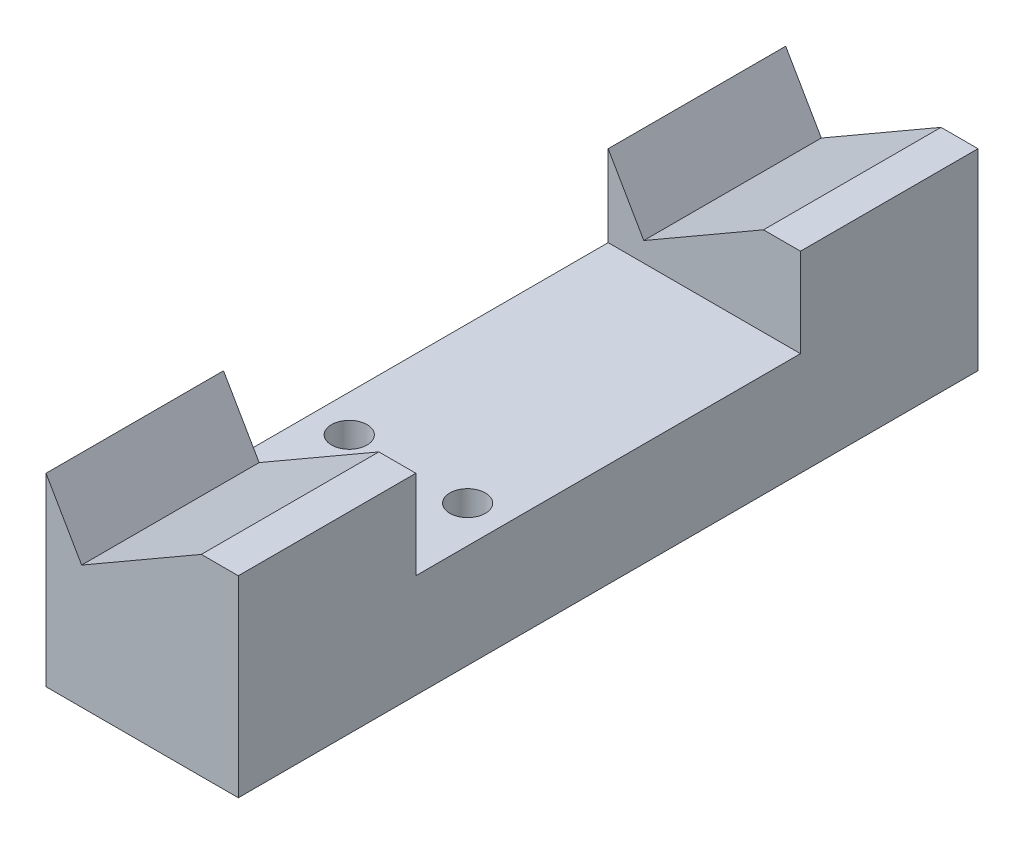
ISO-10303-21;
HEADER;
FILE_DESCRIPTION(('STEP AP214'),'2;1');
FILE_NAME('part.step','',(''),(''),'','','');
FILE_SCHEMA(('AUTOMOTIVE_DESIGN { 1 0 10303 214 1 1 1 1 }'));
ENDSEC;
DATA;
#1=APPLICATION_CONTEXT('core data for automotive mechanical design processes');
#2=APPLICATION_PROTOCOL_DEFINITION('international standard','automotive_design',2000,#1);
#3=PRODUCT_CONTEXT('',#1,'mechanical');
#4=PRODUCT('Part','Part','',(#3));
#5=PRODUCT_RELATED_PRODUCT_CATEGORY('part','',(#4));
#6=PRODUCT_DEFINITION_FORMATION('','',#4);
#7=PRODUCT_DEFINITION_CONTEXT('part definition',#1,'design');
#8=PRODUCT_DEFINITION('design','',#6,#7);
#9=PRODUCT_DEFINITION_SHAPE('','',#8);
#10=(LENGTH_UNIT() NAMED_UNIT(*) SI_UNIT(.MILLI.,.METRE.));
#11=(NAMED_UNIT(*) PLANE_ANGLE_UNIT() SI_UNIT($,.RADIAN.));
#12=(NAMED_UNIT(*) SI_UNIT($,.STERADIAN.) SOLID_ANGLE_UNIT());
#13=UNCERTAINTY_MEASURE_WITH_UNIT(LENGTH_MEASURE(1.E-05),#10,'distance_accuracy_value','');
#14=(GEOMETRIC_REPRESENTATION_CONTEXT(3) GLOBAL_UNCERTAINTY_ASSIGNED_CONTEXT((#13)) GLOBAL_UNIT_ASSIGNED_CONTEXT((#10,
#11,#12)) REPRESENTATION_CONTEXT('',''));
#15=CARTESIAN_POINT('',(0.,0.,0.));
#16=DIRECTION('',(0.,0.,1.));
#17=DIRECTION('',(1.,0.,0.));
#18=AXIS2_PLACEMENT_3D('',#15,#16,#17);
#19=CARTESIAN_POINT('',(6.49999999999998,13.,50.));
#20=DIRECTION('',(0.,-1.,0.));
#21=DIRECTION('',(0.,0.,-1.));
#22=AXIS2_PLACEMENT_3D('',#19,#20,#21);
#23=PLANE('',#22);
#24=DIRECTION('',(0.,0.,-1.));
#25=VECTOR('',#24,1.);
#26=CARTESIAN_POINT('',(6.49999999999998,13.,50.));
#27=LINE('',#26,#25);
#28=CARTESIAN_POINT('',(6.49999999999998,13.,50.));
#29=VERTEX_POINT('',#28);
#30=CARTESIAN_POINT('',(6.49999999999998,13.,38.));
#31=VERTEX_POINT('',#30);
#32=EDGE_CURVE('E203',#29,#31,#27,.T.);
#33=ORIENTED_EDGE('',*,*,#32,.T.);
#34=DIRECTION('',(-1.,0.,0.));
#35=VECTOR('',#34,1.);
#36=CARTESIAN_POINT('',(6.49999999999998,13.,38.));
#37=LINE('',#36,#35);
#38=CARTESIAN_POINT('',(4.,13.,38.));
#39=VERTEX_POINT('',#38);
#40=EDGE_CURVE('E123',#31,#39,#37,.T.);
#41=ORIENTED_EDGE('',*,*,#40,.T.);
#42=DIRECTION('',(0.,0.,-1.));
#43=VECTOR('',#42,1.);
#44=CARTESIAN_POINT('',(4.,13.,50.));
#45=LINE('',#44,#43);
#46=CARTESIAN_POINT('',(4.,13.,50.));
#47=VERTEX_POINT('',#46);
#48=EDGE_CURVE('E199',#47,#39,#45,.T.);
#49=ORIENTED_EDGE('',*,*,#48,.F.);
#50=DIRECTION('',(-1.,0.,0.));
#51=VECTOR('',#50,1.);
#52=CARTESIAN_POINT('',(6.49999999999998,13.,50.));
#53=LINE('',#52,#51);
#54=EDGE_CURVE('E185',#29,#47,#53,.T.);
#55=ORIENTED_EDGE('',*,*,#54,.F.);
#56=EDGE_LOOP('',(#33,#41,#49,#55));
#57=FACE_BOUND('',#56,.T.);
#58=ADVANCED_FACE('F28',(#57),#23,.F.);
#59=CARTESIAN_POINT('',(4.,13.,50.));
#60=DIRECTION('',(0.499999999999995,-0.866025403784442,0.));
#61=DIRECTION('',(0.866025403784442,0.499999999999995,0.));
#62=AXIS2_PLACEMENT_3D('',#59,#60,#61);
#63=PLANE('',#62);
#64=ORIENTED_EDGE('',*,*,#48,.T.);
#65=DIRECTION('',(-0.866025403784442,-0.499999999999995,0.));
#66=VECTOR('',#65,1.);
#67=CARTESIAN_POINT('',(4.,13.,38.));
#68=LINE('',#67,#66);
#69=CARTESIAN_POINT('',(-4.09150635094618,8.32836663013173,38.));
#70=VERTEX_POINT('',#69);
#71=EDGE_CURVE('E158',#39,#70,#68,.T.);
#72=ORIENTED_EDGE('',*,*,#71,.T.);
#73=DIRECTION('',(0.,0.,-1.));
#74=VECTOR('',#73,1.);
#75=CARTESIAN_POINT('',(-4.09150635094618,8.32836663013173,50.));
#76=LINE('',#75,#74);
#77=CARTESIAN_POINT('',(-4.09150635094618,8.32836663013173,50.));
#78=VERTEX_POINT('',#77);
#79=EDGE_CURVE('E195',#78,#70,#76,.T.);
#80=ORIENTED_EDGE('',*,*,#79,.F.);
#81=DIRECTION('',(-0.866025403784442,-0.499999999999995,0.));
#82=VECTOR('',#81,1.);
#83=CARTESIAN_POINT('',(4.,13.,50.));
#84=LINE('',#83,#82);
#85=EDGE_CURVE('E187',#47,#78,#84,.T.);
#86=ORIENTED_EDGE('',*,*,#85,.F.);
#87=EDGE_LOOP('',(#64,#72,#80,#86));
#88=FACE_BOUND('',#87,.T.);
#89=ADVANCED_FACE('F240',(#88),#63,.F.);
#90=CARTESIAN_POINT('',(-4.09150635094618,8.32836663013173,50.));
#91=DIRECTION('',(-0.866025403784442,-0.499999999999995,0.));
#92=DIRECTION('',(0.499999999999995,-0.866025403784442,0.));
#93=AXIS2_PLACEMENT_3D('',#90,#91,#92);
#94=PLANE('',#93);
#95=ORIENTED_EDGE('',*,*,#79,.T.);
#96=DIRECTION('',(-0.499999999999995,0.866025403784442,0.));
#97=VECTOR('',#96,1.);
#98=CARTESIAN_POINT('',(-4.09150635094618,8.32836663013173,38.));
#99=LINE('',#98,#97);
#100=CARTESIAN_POINT('',(-6.50000000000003,12.5,38.));
#101=VERTEX_POINT('',#100);
#102=EDGE_CURVE('E11',#70,#101,#99,.T.);
#103=ORIENTED_EDGE('',*,*,#102,.T.);
#104=DIRECTION('',(0.,0.,-1.));
#105=VECTOR('',#104,1.);
#106=CARTESIAN_POINT('',(-6.50000000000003,12.5,50.));
#107=LINE('',#106,#105);
#108=CARTESIAN_POINT('',(-6.50000000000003,12.5,50.));
#109=VERTEX_POINT('',#108);
#110=EDGE_CURVE('E191',#109,#101,#107,.T.);
#111=ORIENTED_EDGE('',*,*,#110,.F.);
#112=DIRECTION('',(-0.499999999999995,0.866025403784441,0.));
#113=VECTOR('',#112,1.);
#114=CARTESIAN_POINT('',(-4.09150635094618,8.32836663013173,50.));
#115=LINE('',#114,#113);
#116=EDGE_CURVE('E51',#78,#109,#115,.T.);
#117=ORIENTED_EDGE('',*,*,#116,.F.);
#118=EDGE_LOOP('',(#95,#103,#111,#117));
#119=FACE_BOUND('',#118,.T.);
#120=ADVANCED_FACE('F237',(#119),#94,.F.);
#121=CARTESIAN_POINT('',(-6.50000000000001,0.,50.));
#122=DIRECTION('',(1.,0.,0.));
#123=DIRECTION('',(0.,0.,-1.));
#124=AXIS2_PLACEMENT_3D('',#121,#122,#123);
#125=PLANE('',#124);
#126=ORIENTED_EDGE('',*,*,#110,.T.);
#127=DIRECTION('',(0.,-1.,0.));
#128=VECTOR('',#127,1.);
#129=CARTESIAN_POINT('',(-6.50000000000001,7.,38.));
#130=LINE('',#129,#128);
#131=CARTESIAN_POINT('',(-6.50000000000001,7.,38.));
#132=VERTEX_POINT('',#131);
#133=EDGE_CURVE('E145',#101,#132,#130,.T.);
#134=ORIENTED_EDGE('',*,*,#133,.T.);
#135=DIRECTION('',(0.,0.,-1.));
#136=VECTOR('',#135,1.);
#137=CARTESIAN_POINT('',(-6.50000000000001,7.,38.));
#138=LINE('',#137,#136);
#139=CARTESIAN_POINT('',(-6.50000000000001,7.,12.));
#140=VERTEX_POINT('',#139);
#141=EDGE_CURVE('E136',#132,#140,#138,.T.);
#142=ORIENTED_EDGE('',*,*,#141,.T.);
#143=DIRECTION('',(0.,1.,0.));
#144=VECTOR('',#143,1.);
#145=CARTESIAN_POINT('',(-6.50000000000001,7.,12.));
#146=LINE('',#145,#144);
#147=CARTESIAN_POINT('',(-6.50000000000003,12.5,12.));
#148=VERTEX_POINT('',#147);
#149=EDGE_CURVE('E139',#140,#148,#146,.T.);
#150=ORIENTED_EDGE('',*,*,#149,.T.);
#151=CARTESIAN_POINT('',(-6.50000000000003,12.5,0.));
#152=VERTEX_POINT('',#151);
#153=EDGE_CURVE('E190',#148,#152,#107,.T.);
#154=ORIENTED_EDGE('',*,*,#153,.T.);
#155=DIRECTION('',(0.,-1.,0.));
#156=VECTOR('',#155,1.);
#157=CARTESIAN_POINT('',(-6.50000000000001,0.,0.));
#158=LINE('',#157,#156);
#159=CARTESIAN_POINT('',(-6.50000000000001,0.,0.));
#160=VERTEX_POINT('',#159);
#161=EDGE_CURVE('E162',#152,#160,#158,.T.);
#162=ORIENTED_EDGE('',*,*,#161,.T.);
#163=DIRECTION('',(0.,0.,-1.));
#164=VECTOR('',#163,1.);
#165=CARTESIAN_POINT('',(-6.50000000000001,0.,50.));
#166=LINE('',#165,#164);
#167=CARTESIAN_POINT('',(-6.50000000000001,0.,50.));
#168=VERTEX_POINT('',#167);
#169=EDGE_CURVE('E208',#168,#160,#166,.T.);
#170=ORIENTED_EDGE('',*,*,#169,.F.);
#171=DIRECTION('',(0.,-1.,0.));
#172=VECTOR('',#171,1.);
#173=CARTESIAN_POINT('',(-6.50000000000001,0.,50.));
#174=LINE('',#173,#172);
#175=EDGE_CURVE('E179',#109,#168,#174,.T.);
#176=ORIENTED_EDGE('',*,*,#175,.F.);
#177=EDGE_LOOP('',(#126,#134,#142,#150,#154,#162,#170,#176));
#178=FACE_BOUND('',#177,.T.);
#179=ADVANCED_FACE('F30',(#178),#125,.F.);
#180=CARTESIAN_POINT('',(-6.50000000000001,0.,50.));
#181=DIRECTION('',(0.,1.,0.));
#182=DIRECTION('',(0.,0.,1.));
#183=AXIS2_PLACEMENT_3D('',#180,#181,#182);
#184=PLANE('',#183);
#185=CARTESIAN_POINT('',(-4.00000000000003,0.,32.));
#186=DIRECTION('',(0.,1.,0.));
#187=DIRECTION('',(0.,0.,1.));
#188=AXIS2_PLACEMENT_3D('',#185,#186,#187);
#189=CIRCLE('',#188,1.2);
#190=CARTESIAN_POINT('',(-4.00000000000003,0.,33.2));
#191=VERTEX_POINT('',#190);
#192=EDGE_CURVE('E267',#191,#191,#189,.T.);
#193=ORIENTED_EDGE('',*,*,#192,.T.);
#194=EDGE_LOOP('',(#193));
#195=FACE_BOUND('',#194,.T.);
#196=CARTESIAN_POINT('',(3.99999999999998,0.,32.));
#197=DIRECTION('',(0.,1.,0.));
#198=DIRECTION('',(0.,0.,1.));
#199=AXIS2_PLACEMENT_3D('',#196,#197,#198);
#200=CIRCLE('',#199,1.2);
#201=CARTESIAN_POINT('',(3.99999999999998,0.,33.2));
#202=VERTEX_POINT('',#201);
#203=EDGE_CURVE('E270',#202,#202,#200,.T.);
#204=ORIENTED_EDGE('',*,*,#203,.T.);
#205=EDGE_LOOP('',(#204));
#206=FACE_BOUND('',#205,.T.);
#207=DIRECTION('',(1.,0.,0.));
#208=VECTOR('',#207,1.);
#209=CARTESIAN_POINT('',(-6.50000000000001,0.,0.));
#210=LINE('',#209,#208);
#211=CARTESIAN_POINT('',(6.50000000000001,0.,0.));
#212=VERTEX_POINT('',#211);
#213=EDGE_CURVE('E165',#160,#212,#210,.T.);
#214=ORIENTED_EDGE('',*,*,#213,.T.);
#215=DIRECTION('',(0.,0.,-1.));
#216=VECTOR('',#215,1.);
#217=CARTESIAN_POINT('',(6.49999999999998,0.,50.));
#218=LINE('',#217,#216);
#219=CARTESIAN_POINT('',(6.49999999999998,0.,50.));
#220=VERTEX_POINT('',#219);
#221=EDGE_CURVE('E205',#220,#212,#218,.T.);
#222=ORIENTED_EDGE('',*,*,#221,.F.);
#223=DIRECTION('',(1.,0.,0.));
#224=VECTOR('',#223,1.);
#225=CARTESIAN_POINT('',(-6.50000000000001,0.,50.));
#226=LINE('',#225,#224);
#227=EDGE_CURVE('E181',#168,#220,#226,.T.);
#228=ORIENTED_EDGE('',*,*,#227,.F.);
#229=ORIENTED_EDGE('',*,*,#169,.T.);
#230=EDGE_LOOP('',(#214,#222,#228,#229));
#231=FACE_BOUND('',#230,.T.);
#232=ADVANCED_FACE('F234',(#195,#206,#231),#184,.F.);
#233=CARTESIAN_POINT('',(6.49999999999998,0.,50.));
#234=DIRECTION('',(-1.,0.,0.));
#235=DIRECTION('',(0.,-1.,0.));
#236=AXIS2_PLACEMENT_3D('',#233,#234,#235);
#237=PLANE('',#236);
#238=DIRECTION('',(0.,0.,-1.));
#239=VECTOR('',#238,1.);
#240=CARTESIAN_POINT('',(6.49999999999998,7.,38.));
#241=LINE('',#240,#239);
#242=CARTESIAN_POINT('',(6.49999999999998,7.,38.));
#243=VERTEX_POINT('',#242);
#244=CARTESIAN_POINT('',(6.49999999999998,7.,12.));
#245=VERTEX_POINT('',#244);
#246=EDGE_CURVE('E128',#243,#245,#241,.T.);
#247=ORIENTED_EDGE('',*,*,#246,.F.);
#248=DIRECTION('',(0.,-1.,0.));
#249=VECTOR('',#248,1.);
#250=CARTESIAN_POINT('',(6.49999999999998,7.,38.));
#251=LINE('',#250,#249);
#252=EDGE_CURVE('E117',#31,#243,#251,.T.);
#253=ORIENTED_EDGE('',*,*,#252,.F.);
#254=ORIENTED_EDGE('',*,*,#32,.F.);
#255=DIRECTION('',(0.,1.,0.));
#256=VECTOR('',#255,1.);
#257=CARTESIAN_POINT('',(6.49999999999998,0.,50.));
#258=LINE('',#257,#256);
#259=EDGE_CURVE('E183',#220,#29,#258,.T.);
#260=ORIENTED_EDGE('',*,*,#259,.F.);
#261=ORIENTED_EDGE('',*,*,#221,.T.);
#262=DIRECTION('',(0.,1.,0.));
#263=VECTOR('',#262,1.);
#264=CARTESIAN_POINT('',(6.50000000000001,0.,0.));
#265=LINE('',#264,#263);
#266=CARTESIAN_POINT('',(6.49999999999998,13.,0.));
#267=VERTEX_POINT('',#266);
#268=EDGE_CURVE('E167',#212,#267,#265,.T.);
#269=ORIENTED_EDGE('',*,*,#268,.T.);
#270=CARTESIAN_POINT('',(6.49999999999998,13.,12.));
#271=VERTEX_POINT('',#270);
#272=EDGE_CURVE('E202',#271,#267,#27,.T.);
#273=ORIENTED_EDGE('',*,*,#272,.F.);
#274=DIRECTION('',(0.,1.,0.));
#275=VECTOR('',#274,1.);
#276=CARTESIAN_POINT('',(6.49999999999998,7.,12.));
#277=LINE('',#276,#275);
#278=EDGE_CURVE('E143',#245,#271,#277,.T.);
#279=ORIENTED_EDGE('',*,*,#278,.F.);
#280=EDGE_LOOP('',(#247,#253,#254,#260,#261,#269,#273,#279));
#281=FACE_BOUND('',#280,.T.);
#282=ADVANCED_FACE('F141',(#281),#237,.F.);
#283=CARTESIAN_POINT('',(4.,13.,12.));
#284=VERTEX_POINT('',#283);
#285=CARTESIAN_POINT('',(4.,13.,0.));
#286=VERTEX_POINT('',#285);
#287=EDGE_CURVE('E198',#284,#286,#45,.T.);
#288=ORIENTED_EDGE('',*,*,#287,.F.);
#289=DIRECTION('',(1.,0.,0.));
#290=VECTOR('',#289,1.);
#291=CARTESIAN_POINT('',(6.49999999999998,13.,12.));
#292=LINE('',#291,#290);
#293=EDGE_CURVE('E155',#284,#271,#292,.T.);
#294=ORIENTED_EDGE('',*,*,#293,.T.);
#295=ORIENTED_EDGE('',*,*,#272,.T.);
#296=DIRECTION('',(-1.,0.,0.));
#297=VECTOR('',#296,1.);
#298=CARTESIAN_POINT('',(6.49999999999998,13.,0.));
#299=LINE('',#298,#297);
#300=EDGE_CURVE('E170',#267,#286,#299,.T.);
#301=ORIENTED_EDGE('',*,*,#300,.T.);
#302=EDGE_LOOP('',(#288,#294,#295,#301));
#303=FACE_BOUND('',#302,.T.);
#304=ADVANCED_FACE('F230',(#303),#23,.F.);
#305=CARTESIAN_POINT('',(-4.09150635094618,8.32836663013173,12.));
#306=VERTEX_POINT('',#305);
#307=CARTESIAN_POINT('',(-4.09150635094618,8.32836663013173,0.));
#308=VERTEX_POINT('',#307);
#309=EDGE_CURVE('E194',#306,#308,#76,.T.);
#310=ORIENTED_EDGE('',*,*,#309,.F.);
#311=DIRECTION('',(0.866025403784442,0.499999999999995,0.));
#312=VECTOR('',#311,1.);
#313=CARTESIAN_POINT('',(4.,13.,12.));
#314=LINE('',#313,#312);
#315=EDGE_CURVE('E43',#306,#284,#314,.T.);
#316=ORIENTED_EDGE('',*,*,#315,.T.);
#317=ORIENTED_EDGE('',*,*,#287,.T.);
#318=DIRECTION('',(-0.866025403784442,-0.499999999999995,0.));
#319=VECTOR('',#318,1.);
#320=CARTESIAN_POINT('',(4.,13.,0.));
#321=LINE('',#320,#319);
#322=EDGE_CURVE('E173',#286,#308,#321,.T.);
#323=ORIENTED_EDGE('',*,*,#322,.T.);
#324=EDGE_LOOP('',(#310,#316,#317,#323));
#325=FACE_BOUND('',#324,.T.);
#326=ADVANCED_FACE('F216',(#325),#63,.F.);
#327=ORIENTED_EDGE('',*,*,#153,.F.);
#328=DIRECTION('',(0.499999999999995,-0.866025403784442,0.));
#329=VECTOR('',#328,1.);
#330=CARTESIAN_POINT('',(-4.09150635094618,8.32836663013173,12.));
#331=LINE('',#330,#329);
#332=EDGE_CURVE('E36',#148,#306,#331,.T.);
#333=ORIENTED_EDGE('',*,*,#332,.T.);
#334=ORIENTED_EDGE('',*,*,#309,.T.);
#335=DIRECTION('',(-0.499999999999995,0.866025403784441,0.));
#336=VECTOR('',#335,1.);
#337=CARTESIAN_POINT('',(-4.09150635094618,8.32836663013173,0.));
#338=LINE('',#337,#336);
#339=EDGE_CURVE('E176',#308,#152,#338,.T.);
#340=ORIENTED_EDGE('',*,*,#339,.T.);
#341=EDGE_LOOP('',(#327,#333,#334,#340));
#342=FACE_BOUND('',#341,.T.);
#343=ADVANCED_FACE('F213',(#342),#94,.F.);
#344=CARTESIAN_POINT('',(-6.50000000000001,13.,50.));
#345=DIRECTION('',(0.,0.,1.));
#346=DIRECTION('',(1.,0.,0.));
#347=AXIS2_PLACEMENT_3D('',#344,#345,#346);
#348=PLANE('',#347);
#349=ORIENTED_EDGE('',*,*,#175,.T.);
#350=ORIENTED_EDGE('',*,*,#227,.T.);
#351=ORIENTED_EDGE('',*,*,#259,.T.);
#352=ORIENTED_EDGE('',*,*,#54,.T.);
#353=ORIENTED_EDGE('',*,*,#85,.T.);
#354=ORIENTED_EDGE('',*,*,#116,.T.);
#355=EDGE_LOOP('',(#349,#350,#351,#352,#353,#354));
#356=FACE_BOUND('',#355,.T.);
#357=ADVANCED_FACE('F235',(#356),#348,.T.);
#358=CARTESIAN_POINT('',(-6.50000000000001,13.,0.));
#359=DIRECTION('',(0.,0.,1.));
#360=DIRECTION('',(1.,0.,0.));
#361=AXIS2_PLACEMENT_3D('',#358,#359,#360);
#362=PLANE('',#361);
#363=ORIENTED_EDGE('',*,*,#161,.F.);
#364=ORIENTED_EDGE('',*,*,#339,.F.);
#365=ORIENTED_EDGE('',*,*,#322,.F.);
#366=ORIENTED_EDGE('',*,*,#300,.F.);
#367=ORIENTED_EDGE('',*,*,#268,.F.);
#368=ORIENTED_EDGE('',*,*,#213,.F.);
#369=EDGE_LOOP('',(#363,#364,#365,#366,#367,#368));
#370=FACE_BOUND('',#369,.T.);
#371=ADVANCED_FACE('F223',(#370),#362,.F.);
#372=CARTESIAN_POINT('',(-6.50000000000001,7.,38.));
#373=DIRECTION('',(0.,0.,1.));
#374=DIRECTION('',(1.,0.,0.));
#375=AXIS2_PLACEMENT_3D('',#372,#373,#374);
#376=PLANE('',#375);
#377=ORIENTED_EDGE('',*,*,#252,.T.);
#378=DIRECTION('',(1.,0.,0.));
#379=VECTOR('',#378,1.);
#380=CARTESIAN_POINT('',(-6.50000000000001,7.,38.));
#381=LINE('',#380,#379);
#382=EDGE_CURVE('E120',#132,#243,#381,.T.);
#383=ORIENTED_EDGE('',*,*,#382,.F.);
#384=ORIENTED_EDGE('',*,*,#133,.F.);
#385=ORIENTED_EDGE('',*,*,#102,.F.);
#386=ORIENTED_EDGE('',*,*,#71,.F.);
#387=ORIENTED_EDGE('',*,*,#40,.F.);
#388=EDGE_LOOP('',(#377,#383,#384,#385,#386,#387));
#389=FACE_BOUND('',#388,.T.);
#390=ADVANCED_FACE('F119',(#389),#376,.F.);
#391=CARTESIAN_POINT('',(-6.50000000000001,7.,12.));
#392=DIRECTION('',(0.,0.,-1.));
#393=DIRECTION('',(-1.,0.,0.));
#394=AXIS2_PLACEMENT_3D('',#391,#392,#393);
#395=PLANE('',#394);
#396=ORIENTED_EDGE('',*,*,#315,.F.);
#397=ORIENTED_EDGE('',*,*,#332,.F.);
#398=ORIENTED_EDGE('',*,*,#149,.F.);
#399=DIRECTION('',(1.,0.,0.));
#400=VECTOR('',#399,1.);
#401=CARTESIAN_POINT('',(-6.50000000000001,7.,12.));
#402=LINE('',#401,#400);
#403=EDGE_CURVE('E138',#140,#245,#402,.T.);
#404=ORIENTED_EDGE('',*,*,#403,.T.);
#405=ORIENTED_EDGE('',*,*,#278,.T.);
#406=ORIENTED_EDGE('',*,*,#293,.F.);
#407=EDGE_LOOP('',(#396,#397,#398,#404,#405,#406));
#408=FACE_BOUND('',#407,.T.);
#409=ADVANCED_FACE('F228',(#408),#395,.F.);
#410=CARTESIAN_POINT('',(-6.50000000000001,7.,38.));
#411=DIRECTION('',(0.,-1.,0.));
#412=DIRECTION('',(1.,0.,0.));
#413=AXIS2_PLACEMENT_3D('',#410,#411,#412);
#414=PLANE('',#413);
#415=CARTESIAN_POINT('',(-4.,7.,32.));
#416=DIRECTION('',(0.,1.,0.));
#417=DIRECTION('',(0.,0.,1.));
#418=AXIS2_PLACEMENT_3D('',#415,#416,#417);
#419=CIRCLE('',#418,1.19999999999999);
#420=CARTESIAN_POINT('',(-4.,7.,33.2));
#421=VERTEX_POINT('',#420);
#422=EDGE_CURVE('E272',#421,#421,#419,.T.);
#423=ORIENTED_EDGE('',*,*,#422,.F.);
#424=EDGE_LOOP('',(#423));
#425=FACE_BOUND('',#424,.T.);
#426=CARTESIAN_POINT('',(4.,7.,32.));
#427=DIRECTION('',(0.,1.,0.));
#428=DIRECTION('',(0.,0.,1.));
#429=AXIS2_PLACEMENT_3D('',#426,#427,#428);
#430=CIRCLE('',#429,1.19999999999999);
#431=CARTESIAN_POINT('',(4.,7.,33.2));
#432=VERTEX_POINT('',#431);
#433=EDGE_CURVE('E129',#432,#432,#430,.T.);
#434=ORIENTED_EDGE('',*,*,#433,.F.);
#435=EDGE_LOOP('',(#434));
#436=FACE_BOUND('',#435,.T.);
#437=ORIENTED_EDGE('',*,*,#246,.T.);
#438=ORIENTED_EDGE('',*,*,#403,.F.);
#439=ORIENTED_EDGE('',*,*,#141,.F.);
#440=ORIENTED_EDGE('',*,*,#382,.T.);
#441=EDGE_LOOP('',(#437,#438,#439,#440));
#442=FACE_BOUND('',#441,.T.);
#443=ADVANCED_FACE('F133',(#425,#436,#442),#414,.F.);
#444=CARTESIAN_POINT('',(4.,7.,32.));
#445=DIRECTION('',(0.,1.,0.));
#446=DIRECTION('',(0.,0.,1.));
#447=AXIS2_PLACEMENT_3D('',#444,#445,#446);
#448=CYLINDRICAL_SURFACE('',#447,1.19999999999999);
#449=ORIENTED_EDGE('',*,*,#203,.F.);
#450=EDGE_LOOP('',(#449));
#451=FACE_BOUND('',#450,.T.);
#452=ORIENTED_EDGE('',*,*,#433,.T.);
#453=EDGE_LOOP('',(#452));
#454=FACE_BOUND('',#453,.T.);
#455=ADVANCED_FACE('F284',(#451,#454),#448,.F.);
#456=CARTESIAN_POINT('',(-4.,7.,32.));
#457=DIRECTION('',(0.,1.,0.));
#458=DIRECTION('',(0.,0.,1.));
#459=AXIS2_PLACEMENT_3D('',#456,#457,#458);
#460=CYLINDRICAL_SURFACE('',#459,1.19999999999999);
#461=ORIENTED_EDGE('',*,*,#192,.F.);
#462=EDGE_LOOP('',(#461));
#463=FACE_BOUND('',#462,.T.);
#464=ORIENTED_EDGE('',*,*,#422,.T.);
#465=EDGE_LOOP('',(#464));
#466=FACE_BOUND('',#465,.T.);
#467=ADVANCED_FACE('F280',(#463,#466),#460,.F.);
#468=CLOSED_SHELL('',(#58,#89,#120,#179,#232,#282,#304,#326,#343,#357,#371,#390,#409,#443,#455,#467));
#469=MANIFOLD_SOLID_BREP('B2',#468);
#470=ADVANCED_BREP_SHAPE_REPRESENTATION('',(#18,#469),#14);
#471=SHAPE_DEFINITION_REPRESENTATION(#9,#470);
ENDSEC;
END-ISO-10303-21;
